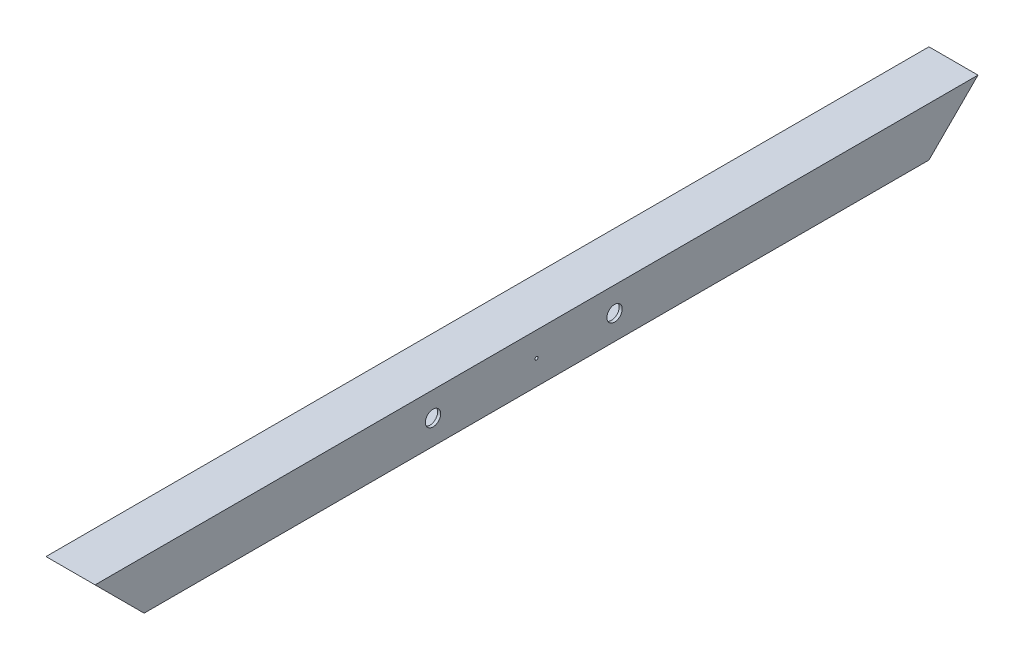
from build123d import *

# Parameters (mm, degrees)
SKETCH1_W               = 50.8
SKETCH1_H               = 50.8
SKETCH1_W_2             = 44.45
SKETCH1_H_2             = 44.45
BOSS_EXTRUDE1_DEPTH     = 914.4
CUT_EXTRUDE1_DEPTH      = 917.162190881
CUT_EXTRUDE1_DEPTH_BACK = 917.162190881
CUT_EXTRUDE2_DEPTH      = 917.162190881
CUT_EXTRUDE2_DEPTH_BACK = 917.162190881
SKETCH4_R               = 7.9375
CUT_EXTRUDE3_DEPTH      = 917.162190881
SKETCH5_R               = 1.5875
CUT_EXTRUDE4_DEPTH      = 917.162190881


with BuildPart() as part:
    # Sketch1 → Boss-Extrude1 (new body)
    with BuildSketch(Plane.XY):
        Rectangle(SKETCH1_W, SKETCH1_H)
        Rectangle(SKETCH1_W_2, SKETCH1_H_2, mode=Mode.SUBTRACT)
    extrude(amount=-BOSS_EXTRUDE1_DEPTH)

    # Sketch2 → Cut-Extrude1 (cut, two sides: drawn at the far end of the back side and taken through both)
    with BuildSketch(Plane.ZY.offset(25.4).offset(-CUT_EXTRUDE1_DEPTH_BACK)):
        Polygon((-2216.622024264, 1327.622024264), (-914.4, 25.4), (-863.6, -25.4), (438.622024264, -1327.622024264), (-2165.822024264, -3932.066072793), (-4821.066072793, -1276.822024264), align=None)
    extrude(amount=CUT_EXTRUDE1_DEPTH + CUT_EXTRUDE1_DEPTH_BACK, mode=Mode.SUBTRACT)

    # Sketch3 → Cut-Extrude2 (cut, two sides: drawn at the far end of the back side and taken through both)
    with BuildSketch(Plane.ZY.offset(25.4).offset(-CUT_EXTRUDE2_DEPTH_BACK)):
        Polygon((1302.222024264, 1327.622024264), (0, 25.4), (-50.8, -25.4), (-1353.022024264, -1327.622024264), (1251.422024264, -3932.066072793), (3906.666072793, -1276.822024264), align=None)
    extrude(amount=CUT_EXTRUDE2_DEPTH + CUT_EXTRUDE2_DEPTH_BACK, mode=Mode.SUBTRACT)

    # Sketch4 → Cut-Extrude3 (cut, through all)
    with BuildSketch(Plane.ZY.offset(25.4)):
        with Locations((-538.0228, 0)):
            Circle(SKETCH4_R)
        with Locations((-350.012, 0)):
            Circle(SKETCH4_R)
    extrude(amount=-CUT_EXTRUDE3_DEPTH, mode=Mode.SUBTRACT)

    # Sketch5 → Cut-Extrude4 (cut, through all)
    with BuildSketch(Plane.ZY.offset(25.4)):
        with Locations((-457.2, 0)):
            Circle(SKETCH5_R)
    extrude(amount=-CUT_EXTRUDE4_DEPTH, mode=Mode.SUBTRACT)


solid = part.part
